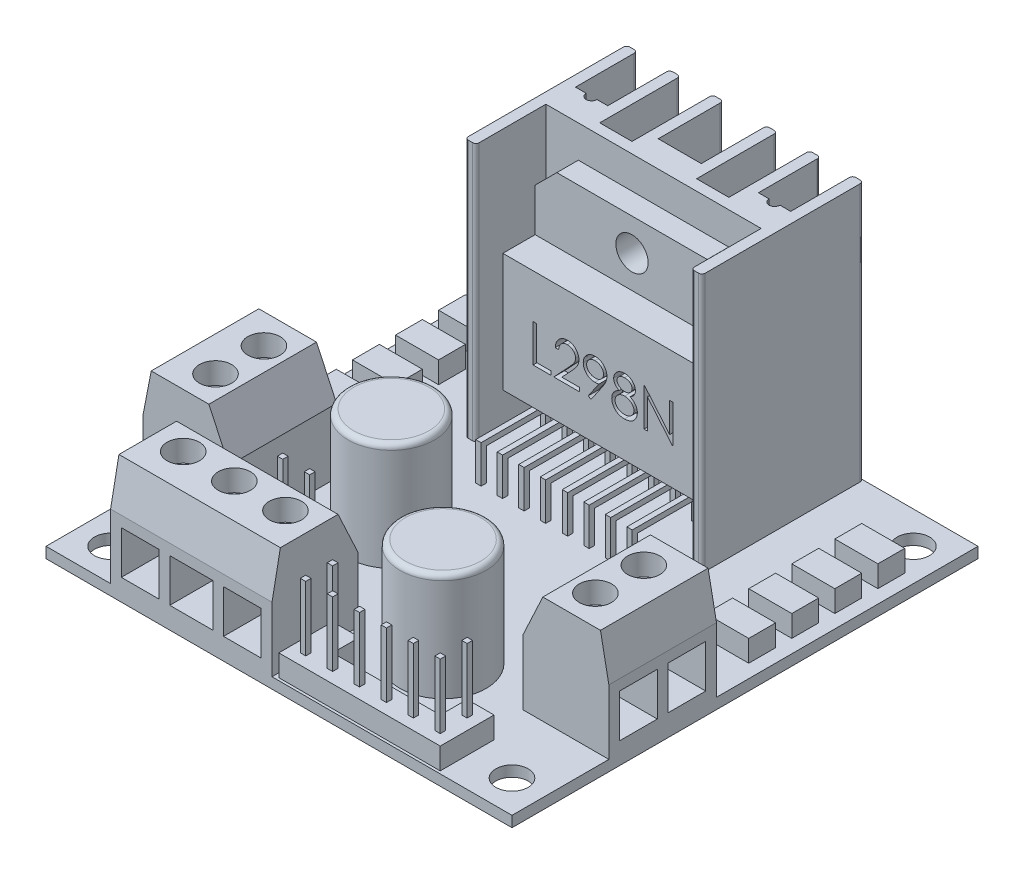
from build123d import *

# Parameters (mm, degrees)
CROQUIS1_W               = 43.3
CROQUIS1_H               = 43.3
CROQUIS1_R               = 1.5
SALIENTE_EXTRUIR1_DEPTH  = 1
CROQUIS2_W               = 1
CROQUIS2_H               = 1
CROQUIS2_H_2             = 6.5
CROQUIS2_W_2             = 3
CROQUIS2_W_3             = 2
CROQUIS2_H_3             = 1.435307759
SALIENTE_EXTRUIR2_DEPTH  = 24
CROQUIS3_W               = 8
CROQUIS3_H               = 10
SALIENTE_EXTRUIR3_DEPTH  = 10
CHAFL_N1_SIZE            = 4
CHAFL_N1_SIZE2           = 1.865230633
CHAFL_N2_SIZE            = 4
CHAFL_N2_SIZE2           = 1.865230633
CHAFL_N3_SIZE            = 4
CHAFL_N3_SIZE2           = 0.777521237
CHAFL_N4_SIZE            = 4
CHAFL_N4_SIZE2           = 0.777521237
CROQUIS4_W               = 15
CROQUIS4_H               = 8
SALIENTE_EXTRUIR4_DEPTH  = 10
CHAFL_N5_SIZE            = 4
CHAFL_N5_SIZE2           = 0.777521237
CHAFL_N6_SIZE            = 4
CHAFL_N6_SIZE2           = 1.865230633
CROQUIS5_W               = 4
CROQUIS5_H               = 2.5
SALIENTE_EXTRUIR5_DEPTH  = 2
CROQUIS6_R               = 4
SALIENTE_EXTRUIR6_DEPTH  = 10
REDONDEO1_R              = 0.5
SALIENTE_EXTRUIR7_DEPTH  = 2
CROQUIS8_W               = 2.5
CROQUIS8_H               = 2.5
SALIENTE_EXTRUIR8_DEPTH  = 2
CROQUIS9_W               = 0.25
CROQUIS9_H               = 0.25
CROQUIS9_H_2             = 0.5
CROQUIS9_W_2             = 0.5
SALIENTE_EXTRUIR9_DEPTH  = 6
CROQUIS10_W              = 0.5
CROQUIS10_H              = 0.5
SALIENTE_EXTRUIR10_DEPTH = 6
CROQUIS11_W              = 9
CROQUIS11_H              = 10
SALIENTE_EXTRUIR11_DEPTH = 5
CORTAR_EXTRUIR1_DEPTH    = 3
CROQUIS13_W              = 0.5
CROQUIS13_H              = 0.5
SALIENTE_EXTRUIR12_DEPTH = 1
CROQUIS14_W              = 0.5
CROQUIS14_H              = 0.5
SALIENTE_EXTRUIR13_DEPTH = 7
CROQUIS15_W              = 0.5
CROQUIS15_H              = 0.5
SALIENTE_EXTRUIR14_DEPTH = 4
CROQUIS16_W              = 0.5
CROQUIS16_H              = 0.5
SALIENTE_EXTRUIR15_DEPTH = 4
CORTAR_EXTRUIR2_DEPTH    = 1
CROQUIS18_R              = 1.5
CORTAR_EXTRUIR3_DEPTH    = 60.797407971
CROQUIS19_W              = 3.5
CROQUIS19_H              = 4
CORTAR_EXTRUIR4_DEPTH    = 4
CROQUIS20_W              = 3.5
CROQUIS20_H              = 4
CROQUIS20_W_2            = 4
CORTAR_EXTRUIR5_DEPTH    = 4
CROQUIS21_W              = 3.5
CROQUIS21_H              = 4
CORTAR_EXTRUIR6_DEPTH    = 4
CROQUIS22_R              = 1.5
CORTAR_EXTRUIR7_DEPTH    = 2
REDONDEO2_R              = 0.3


with BuildPart() as part:
    # Croquis1 → Saliente-Extruir1 (new body)
    with BuildSketch(Plane(origin=(0, 0, 0), x_dir=(1, 0, 0), z_dir=(0, 1, 0))):
        with Locations((-21.65, -21.65)):
            Rectangle(CROQUIS1_W, CROQUIS1_H)
        with Locations(Location((-40.3, -3, 0), (0, 0, 270))):
            Circle(CROQUIS1_R, mode=Mode.SUBTRACT)
        with Locations(Location((-3, -3, 0), (0, 0, 270))):
            Circle(CROQUIS1_R, mode=Mode.SUBTRACT)
        with Locations(Location((-40.3, -40.3, 0), (0, 0, 270))):
            Circle(CROQUIS1_R, mode=Mode.SUBTRACT)
        with Locations(Location((-3, -40.3, 0), (0, 0, 270))):
            Circle(CROQUIS1_R, mode=Mode.SUBTRACT)
    extrude(amount=SALIENTE_EXTRUIR1_DEPTH)

    # Croquis2 → Saliente-Extruir2 (add)
    with BuildSketch(Plane(origin=(0, 1, 0), x_dir=(-1, 0, 0), z_dir=(0, 1, 0))):
        Polygon((31.65, 5.75316787), (31.65, 0), (32.65, 0), (32.65, 7.5), (31.65, 7.5), align=None)
        with Locations((32.15, 8)):
            Rectangle(CROQUIS2_W, CROQUIS2_H)
        with Locations((32.15, 11.75)):
            Rectangle(CROQUIS2_W, CROQUIS2_H_2)
        with Locations((30.15, 8)):
            Rectangle(CROQUIS2_W_2, CROQUIS2_H)
        with Locations((28.15, 8)):
            Rectangle(CROQUIS2_W, CROQUIS2_H)
        with BuildLine():
            Line((31.65, 7.5), (28.65, 7.5))
            Line((28.65, 7.5), (28.65, 5.75316787))
            Line((28.65, 5.75316787), (29.645779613, 5.75316787))
            ThreePointArc((29.645779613, 5.75316787), (30.15, 6.257388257), (30.654220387, 5.75316787))
            Line((30.654220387, 5.75316787), (31.65, 5.75316787))
            Line((31.65, 5.75316787), (31.65, 7.5))
        make_face()
        with Locations((22.65, 6.782346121)):
            Rectangle(CROQUIS2_W_3, CROQUIS2_H_3)
        with Locations((20.65, 6.782346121)):
            Rectangle(CROQUIS2_W_3, CROQUIS2_H_3)
        Polygon((23.65, 6.064692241), (23.65, 0), (24.65, 0), (24.65, 7.5), (23.65, 7.5), align=None)
        Polygon((27.65, 7.5), (27.65, 0), (28.65, 0), (28.65, 5.75316787), (28.65, 7.5), align=None)
        with Locations((26.15, 8)):
            Rectangle(CROQUIS2_W_2, CROQUIS2_H)
        with Locations((24.15, 8)):
            Rectangle(CROQUIS2_W, CROQUIS2_H)
        with Locations((22.65, 8)):
            Rectangle(CROQUIS2_W_3, CROQUIS2_H)
        with Locations((20.65, 8)):
            Rectangle(CROQUIS2_W_3, CROQUIS2_H)
        with Locations((19.15, 8)):
            Rectangle(CROQUIS2_W, CROQUIS2_H)
        Polygon((18.65, 7.5), (18.65, 0), (19.65, 0), (19.65, 6.064692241), (19.65, 7.5), align=None)
        with Locations((17.15, 8)):
            Rectangle(CROQUIS2_W_2, CROQUIS2_H)
        with Locations((15.15, 8)):
            Rectangle(CROQUIS2_W, CROQUIS2_H)
        with Locations((13.15, 8)):
            Rectangle(CROQUIS2_W_2, CROQUIS2_H)
        with Locations((11.15, 11.75)):
            Rectangle(CROQUIS2_W, CROQUIS2_H_2)
        with Locations((11.15, 8)):
            Rectangle(CROQUIS2_W, CROQUIS2_H)
        Polygon((10.65, 7.5), (10.65, 0), (11.65, 0), (11.65, 5.75316787), (11.65, 7.5), align=None)
        with BuildLine():
            Line((14.65, 7.5), (11.65, 7.5))
            Line((11.65, 7.5), (11.65, 5.75316787))
            Line((11.65, 5.75316787), (12.645779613, 5.75316787))
            ThreePointArc((12.645779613, 5.75316787), (13.15, 6.257388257), (13.654220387, 5.75316787))
            Line((13.654220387, 5.75316787), (14.65, 5.75316787))
            Line((14.65, 5.75316787), (14.65, 7.5))
        make_face()
        Polygon((14.65, 5.75316787), (14.65, 0), (15.65, 0), (15.65, 7.5), (14.65, 7.5), align=None)
    extrude(amount=SALIENTE_EXTRUIR2_DEPTH)

    # Croquis3 → Saliente-Extruir3 (add)
    with BuildSketch(Plane(origin=(0, 1, 0), x_dir=(-1, 0, 0), z_dir=(0, 1, 0))):
        with Locations((39.3, 29.3)):
            Rectangle(CROQUIS3_W, CROQUIS3_H)
        with Locations((4, 29.3)):
            Rectangle(CROQUIS3_W, CROQUIS3_H)
    extrude(amount=SALIENTE_EXTRUIR3_DEPTH)

    # Chafl_n1
    chafl_n1_edges = [part.edges().sort_by_distance(p)[0] for p in [
        (-35.3, 11, 29.3),
    ]]
    chafl_n1_side = [part.faces().sort_by_distance(p)[0] for p in [
        (-35.3, 6, 29.3),
    ]]
    chamfer(chafl_n1_edges, length=CHAFL_N1_SIZE, length2=CHAFL_N1_SIZE2, reference=chafl_n1_side[0])

    # Chafl_n2
    chafl_n2_edges = [part.edges().sort_by_distance(p)[0] for p in [
        (-8, 11, 29.3),
    ]]
    chafl_n2_side = [part.faces().sort_by_distance(p)[0] for p in [
        (-8, 6, 29.3),
    ]]
    chamfer(chafl_n2_edges, length=CHAFL_N2_SIZE, length2=CHAFL_N2_SIZE2, reference=chafl_n2_side[0])

    # Chafl_n3
    chafl_n3_edges = [part.edges().sort_by_distance(p)[0] for p in [
        (0, 11, 29.3),
    ]]
    chafl_n3_side = [part.faces().sort_by_distance(p)[0] for p in [
        (0, 4.338101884, 26.988450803),
    ]]
    chamfer(chafl_n3_edges, length=CHAFL_N3_SIZE, length2=CHAFL_N3_SIZE2, reference=chafl_n3_side[0])

    # Chafl_n4
    chafl_n4_edges = [part.edges().sort_by_distance(p)[0] for p in [
        (-43.3, 11, 29.3),
    ]]
    chafl_n4_side = [part.faces().sort_by_distance(p)[0] for p in [
        (-43.3, 4.338101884, 26.988450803),
    ]]
    chamfer(chafl_n4_edges, length=CHAFL_N4_SIZE, length2=CHAFL_N4_SIZE2, reference=chafl_n4_side[0])

    # Croquis4 → Saliente-Extruir4 (add)
    with BuildSketch(Plane(origin=(0, 1, 0), x_dir=(-1, 0, 0), z_dir=(0, 1, 0))):
        with Locations((29.8, 39.3)):
            Rectangle(CROQUIS4_W, CROQUIS4_H)
    extrude(amount=SALIENTE_EXTRUIR4_DEPTH)

    # Chafl_n5
    chafl_n5_edges = [part.edges().sort_by_distance(p)[0] for p in [
        (-29.8, 11, 43.3),
    ]]
    chafl_n5_side = [part.faces().sort_by_distance(p)[0] for p in [
        (-27.97436627, 4.767977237, 43.3),
    ]]
    chamfer(chafl_n5_edges, length=CHAFL_N5_SIZE, length2=CHAFL_N5_SIZE2, reference=chafl_n5_side[0])

    # Chafl_n6
    chafl_n6_edges = [part.edges().sort_by_distance(p)[0] for p in [
        (-29.8, 11, 35.3),
    ]]
    chafl_n6_side = [part.faces().sort_by_distance(p)[0] for p in [
        (-29.8, 6, 35.3),
    ]]
    chamfer(chafl_n6_edges, length=CHAFL_N6_SIZE, length2=CHAFL_N6_SIZE2, reference=chafl_n6_side[0])

    # Croquis5 → Saliente-Extruir5 (add)
    with BuildSketch(Plane(origin=(0, 1, 0), x_dir=(-1, 0, 0), z_dir=(0, 1, 0))):
        with Locations((40.060783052, 10.814133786)):
            Rectangle(CROQUIS5_W, CROQUIS5_H)
        with Locations((40.060783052, 6.814133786)):
            Rectangle(CROQUIS5_W, CROQUIS5_H)
        with Locations((40.060783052, 14.814133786)):
            Rectangle(CROQUIS5_W, CROQUIS5_H)
        with Locations((40.060783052, 18.814133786)):
            Rectangle(CROQUIS5_W, CROQUIS5_H)
        with Locations((3.239216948, 6.814133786)):
            Rectangle(CROQUIS5_W, CROQUIS5_H)
        with Locations((3.239216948, 10.814133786)):
            Rectangle(CROQUIS5_W, CROQUIS5_H)
        with Locations((3.239216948, 14.814133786)):
            Rectangle(CROQUIS5_W, CROQUIS5_H)
        with Locations((3.239216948, 18.814133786)):
            Rectangle(CROQUIS5_W, CROQUIS5_H)
    extrude(amount=SALIENTE_EXTRUIR5_DEPTH)

    # Croquis6 → Saliente-Extruir6 (add)
    with BuildSketch(Plane(origin=(0, 1, 0), x_dir=(-1, 0, 0), z_dir=(0, 1, 0))):
        with Locations(Location((28.3, 26.210008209, 0), (0, 0, 90))):
            Circle(CROQUIS6_R)
        with Locations(Location((15.406645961, 34.3, 0), (0, 0, 90))):
            Circle(CROQUIS6_R)
    extrude(amount=SALIENTE_EXTRUIR6_DEPTH)

    # Redondeo1
    redondeo1_edges = [part.edges().sort_by_distance(p)[0] for p in [
        (-28.3, 11, 22.210008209),
        (-15.406645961, 11, 30.3),
    ]]
    fillet(redondeo1_edges, radius=REDONDEO1_R)

    # Croquis7 → Saliente-Extruir7 (add)
    with BuildSketch(Plane(origin=(0, 1, 0), x_dir=(-1, 0, 0), z_dir=(0, 1, 0))):
        Polygon((19.407725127, 40.559550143), (19.407725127, 38.059550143), (21.907725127, 38.059550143), (21.907725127, 40.559550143), (21.907725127, 43.059550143), (6.907725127, 43.059550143), (6.907725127, 38.059550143), (9.407725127, 38.059550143), (9.407725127, 40.559550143), align=None)
    extrude(amount=SALIENTE_EXTRUIR7_DEPTH)

    # Croquis8 → Saliente-Extruir8 (add)
    with BuildSketch(Plane(origin=(0, 1, 0), x_dir=(-1, 0, 0), z_dir=(0, 1, 0))):
        with Locations((29.05, 33.05)):
            Rectangle(CROQUIS8_W, CROQUIS8_H)
        with Locations((31.55, 33.05)):
            Rectangle(CROQUIS8_W, CROQUIS8_H)
    extrude(amount=SALIENTE_EXTRUIR8_DEPTH)

    # Croquis9 → Saliente-Extruir9 (add)
    with BuildSketch(Plane(origin=(0, 3, 0), x_dir=(-1, 0, 0), z_dir=(0, 1, 0))):
        with Locations((20.532725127, 41.934550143)):
            Rectangle(CROQUIS9_W, CROQUIS9_H)
        with Locations((20.532725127, 41.684550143)):
            Rectangle(CROQUIS9_W, CROQUIS9_H)
        with Locations((20.782725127, 41.934550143)):
            Rectangle(CROQUIS9_W, CROQUIS9_H)
        with Locations((20.782725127, 41.684550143)):
            Rectangle(CROQUIS9_W, CROQUIS9_H)
        with Locations((20.532725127, 39.309550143)):
            Rectangle(CROQUIS9_W, CROQUIS9_H_2)
        with Locations((20.782725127, 39.309550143)):
            Rectangle(CROQUIS9_W, CROQUIS9_H_2)
        with Locations((18.157725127, 41.684550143)):
            Rectangle(CROQUIS9_W_2, CROQUIS9_H)
        with Locations((18.157725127, 41.934550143)):
            Rectangle(CROQUIS9_W_2, CROQUIS9_H)
        with Locations((15.657725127, 41.684550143)):
            Rectangle(CROQUIS9_W_2, CROQUIS9_H)
        with Locations((15.657725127, 41.934550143)):
            Rectangle(CROQUIS9_W_2, CROQUIS9_H)
        with Locations((13.157725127, 41.934550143)):
            Rectangle(CROQUIS9_W_2, CROQUIS9_H)
        with Locations((13.157725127, 41.684550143)):
            Rectangle(CROQUIS9_W_2, CROQUIS9_H)
        with Locations((10.657725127, 41.934550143)):
            Rectangle(CROQUIS9_W_2, CROQUIS9_H)
        with Locations((10.657725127, 41.684550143)):
            Rectangle(CROQUIS9_W_2, CROQUIS9_H)
        with Locations((8.032725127, 41.934550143)):
            Rectangle(CROQUIS9_W, CROQUIS9_H)
        with Locations((8.032725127, 41.684550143)):
            Rectangle(CROQUIS9_W, CROQUIS9_H)
        with Locations((8.282725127, 41.684550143)):
            Rectangle(CROQUIS9_W, CROQUIS9_H)
        with Locations((8.282725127, 41.934550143)):
            Rectangle(CROQUIS9_W, CROQUIS9_H)
        with Locations((8.032725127, 39.309550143)):
            Rectangle(CROQUIS9_W, CROQUIS9_H_2)
        with Locations((8.282725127, 39.309550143)):
            Rectangle(CROQUIS9_W, CROQUIS9_H_2)
    extrude(amount=SALIENTE_EXTRUIR9_DEPTH)

    # Croquis10 → Saliente-Extruir10 (add)
    with BuildSketch(Plane(origin=(0, 3, 0), x_dir=(1, 0, 0), z_dir=(0, 1, 0))):
        with Locations((-29.05, -33.05)):
            Rectangle(CROQUIS10_W, CROQUIS10_H)
        with Locations((-31.55, -33.05)):
            Rectangle(CROQUIS10_W, CROQUIS10_H)
    extrude(amount=SALIENTE_EXTRUIR10_DEPTH)

    # Croquis11 → Saliente-Extruir11 (add)
    with BuildSketch(Plane.XY.offset(8.5)):
        Polygon((-21.65, 15), (-21.65, 22), (-28.637466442, 22), (-30.65, 19.987466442), (-30.65, 15), align=None)
        Polygon((-14.662533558, 22), (-21.65, 22), (-21.65, 15), (-12.65, 15), (-12.65, 19.987466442), align=None)
        with Locations((-26.15, 10)):
            Rectangle(CROQUIS11_W, CROQUIS11_H)
        with Locations((-17.15, 10)):
            Rectangle(CROQUIS11_W, CROQUIS11_H)
    extrude(amount=SALIENTE_EXTRUIR11_DEPTH)

    # Croquis12 → Cortar-Extruir1 (cut)
    with BuildSketch(Plane.XY.offset(13.5)):
        Polygon((-14.662533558, 22), (-28.637466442, 22), (-30.65, 19.987466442), (-30.65, 16), (-12.65, 16), (-12.65, 19.987466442), align=None)
    extrude(amount=-CORTAR_EXTRUIR1_DEPTH, mode=Mode.SUBTRACT)

    # Croquis13 → Saliente-Extruir12 (add)
    with BuildSketch(Plane.XZ.offset(-5)):
        with Locations((-28.173070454, 11)):
            Rectangle(CROQUIS13_W, CROQUIS13_H)
        with Locations((-29.173070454, 11)):
            Rectangle(CROQUIS13_W, CROQUIS13_H)
        with Locations((-27.173070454, 11)):
            Rectangle(CROQUIS13_W, CROQUIS13_H)
        with Locations((-26.173070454, 11)):
            Rectangle(CROQUIS13_W, CROQUIS13_H)
        with Locations((-25.173070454, 11)):
            Rectangle(CROQUIS13_W, CROQUIS13_H)
        with Locations((-24.173070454, 11)):
            Rectangle(CROQUIS13_W, CROQUIS13_H)
        with Locations((-23.173070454, 11)):
            Rectangle(CROQUIS13_W, CROQUIS13_H)
        with Locations((-22.173070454, 11)):
            Rectangle(CROQUIS13_W, CROQUIS13_H)
        with Locations((-21.126929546, 11)):
            Rectangle(CROQUIS13_W, CROQUIS13_H)
        with Locations((-20.126929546, 11)):
            Rectangle(CROQUIS13_W, CROQUIS13_H)
        with Locations((-19.126929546, 11)):
            Rectangle(CROQUIS13_W, CROQUIS13_H)
        with Locations((-18.126929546, 11)):
            Rectangle(CROQUIS13_W, CROQUIS13_H)
        with Locations((-17.126929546, 11)):
            Rectangle(CROQUIS13_W, CROQUIS13_H)
        with Locations((-16.126929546, 11)):
            Rectangle(CROQUIS13_W, CROQUIS13_H)
        with Locations((-15.126929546, 11)):
            Rectangle(CROQUIS13_W, CROQUIS13_H)
        with Locations((-14.126929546, 11)):
            Rectangle(CROQUIS13_W, CROQUIS13_H)
    extrude(amount=SALIENTE_EXTRUIR12_DEPTH)

    # Croquis14 → Saliente-Extruir13 (add)
    with BuildSketch(Plane.XY.offset(11.25)):
        with Locations((-14.126929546, 4.25)):
            Rectangle(CROQUIS14_W, CROQUIS14_H)
        with Locations((-16.126929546, 4.25)):
            Rectangle(CROQUIS14_W, CROQUIS14_H)
        with Locations((-18.126929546, 4.25)):
            Rectangle(CROQUIS14_W, CROQUIS14_H)
        with Locations((-20.126929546, 4.25)):
            Rectangle(CROQUIS14_W, CROQUIS14_H)
        with Locations((-22.173070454, 4.25)):
            Rectangle(CROQUIS14_W, CROQUIS14_H)
        with Locations((-24.173070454, 4.25)):
            Rectangle(CROQUIS14_W, CROQUIS14_H)
        with Locations((-26.173070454, 4.25)):
            Rectangle(CROQUIS14_W, CROQUIS14_H)
        with Locations((-28.173070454, 4.25)):
            Rectangle(CROQUIS14_W, CROQUIS14_H)
    extrude(amount=SALIENTE_EXTRUIR13_DEPTH)

    # Croquis15 → Saliente-Extruir14 (add)
    with BuildSketch(Plane.XZ):
        with Locations((-28.173070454, 18)):
            Rectangle(CROQUIS15_W, CROQUIS15_H)
        with Locations((-26.173070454, 18)):
            Rectangle(CROQUIS15_W, CROQUIS15_H)
        with Locations((-24.173070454, 18)):
            Rectangle(CROQUIS15_W, CROQUIS15_H)
        with Locations((-22.173070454, 18)):
            Rectangle(CROQUIS15_W, CROQUIS15_H)
        with Locations((-20.126929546, 18)):
            Rectangle(CROQUIS15_W, CROQUIS15_H)
        with Locations((-18.126929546, 18)):
            Rectangle(CROQUIS15_W, CROQUIS15_H)
        with Locations((-16.126929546, 18)):
            Rectangle(CROQUIS15_W, CROQUIS15_H)
        with Locations((-14.126929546, 18)):
            Rectangle(CROQUIS15_W, CROQUIS15_H)
    extrude(amount=-SALIENTE_EXTRUIR14_DEPTH)

    # Croquis16 → Saliente-Extruir15 (add)
    with BuildSketch(Plane.XZ):
        with Locations((-29.173070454, 11)):
            Rectangle(CROQUIS16_W, CROQUIS16_H)
        with Locations((-27.173070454, 11)):
            Rectangle(CROQUIS16_W, CROQUIS16_H)
        with Locations((-25.173070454, 11)):
            Rectangle(CROQUIS16_W, CROQUIS16_H)
        with Locations((-23.173070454, 11)):
            Rectangle(CROQUIS16_W, CROQUIS16_H)
        with Locations((-21.126929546, 11)):
            Rectangle(CROQUIS16_W, CROQUIS16_H)
        with Locations((-19.126929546, 11)):
            Rectangle(CROQUIS16_W, CROQUIS16_H)
        with Locations((-17.126929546, 11)):
            Rectangle(CROQUIS16_W, CROQUIS16_H)
        with Locations((-15.126929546, 11)):
            Rectangle(CROQUIS16_W, CROQUIS16_H)
    extrude(amount=-SALIENTE_EXTRUIR15_DEPTH)

    # Croquis17 → Cortar-Extruir2 (cut)
    # profile 1 of 5: a face of its own
    with BuildSketch(Plane.XY.offset(13.5)):
        Polygon((-27.846931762, 11.915865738), (-27.532829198, 11.915865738), (-27.532829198, 8.774840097), (-26.186675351, 8.774840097), (-26.186675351, 8.415865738), (-27.846931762, 8.415865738), align=None)
    # profile 2 of 5: a face of its own
    with BuildSketch(Plane.XY.offset(13.5)):
        with BuildLine():
            Line((-25.468726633, 10.838942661), (-25.782829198, 10.838942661))
            add(Edge.make_bspline(
                [(-25.782829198, 10.838942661), (-25.780782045, 10.880613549), (-25.77676149, 10.962454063), (-25.757933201, 11.08177797), (-25.730992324, 11.195832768), (-25.69290087, 11.303702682), (-25.645594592, 11.40634149), (-25.588864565, 11.503341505), (-25.521670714, 11.594332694), (-25.44546398, 11.678471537), (-25.362695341, 11.755659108), (-25.273389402, 11.822314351), (-25.179544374, 11.878632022), (-25.081444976, 11.925713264), (-24.977984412, 11.96105311), (-24.870101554, 11.98727475), (-24.757322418, 12.003051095), (-24.680482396, 12.004746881), (-24.641402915, 12.005609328)],
                knots=[0, 0, 0, 0, 1.10065271, 2.161652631, 3.183658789, 4.190468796, 5.17591951, 6.163126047, 7.15150782, 8.156236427, 9.156009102, 10.134482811, 11.092018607, 12.041330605, 13.001268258, 13.972401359, 14.968799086, 16, 16, 16, 16], degree=3))
            add(Edge.make_bspline(
                [(-24.641402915, 12.005609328), (-24.603024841, 12.004710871), (-24.527613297, 12.002945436), (-24.417551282, 11.987784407), (-24.312773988, 11.964038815), (-24.213486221, 11.930723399), (-24.120480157, 11.885938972), (-24.033057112, 11.832141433), (-23.950176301, 11.769921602), (-23.875569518, 11.696667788), (-23.807061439, 11.618465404), (-23.747959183, 11.5349775), (-23.69734602, 11.448748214), (-23.65515834, 11.359120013), (-23.624102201, 11.265248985), (-23.600523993, 11.168501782), (-23.587196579, 11.067876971), (-23.585151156, 10.999770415), (-23.584111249, 10.965144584)],
                knots=[0, 0, 0, 0, 1.111607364, 2.184268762, 3.212621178, 4.221274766, 5.211760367, 6.196651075, 7.1921475, 8.207485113, 9.220403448, 10.201281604, 11.166441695, 12.114753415, 13.065576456, 14.026450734, 14.996634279, 16, 16, 16, 16], degree=3))
            add(Edge.make_bspline(
                [(-23.584111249, 10.965144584), (-23.585804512, 10.916396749), (-23.589161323, 10.819756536), (-23.6178757, 10.677741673), (-23.662722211, 10.540148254), (-23.716719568, 10.429410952), (-23.771192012, 10.340177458), (-23.820279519, 10.266708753), (-23.87774433, 10.187603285), (-23.944422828, 10.103125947), (-24.0189357, 10.012615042), (-24.101957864, 9.916125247), (-24.194081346, 9.814653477), (-24.258739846, 9.745347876), (-24.292244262, 9.709435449)],
                knots=[0, 0, 0, 0, 1.184426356, 2.348067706, 3.509069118, 4.696110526, 5.333549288, 6.050745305, 6.844228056, 7.710549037, 8.667450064, 9.695053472, 10.805634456, 12, 12, 12, 12], degree=3))
            Line((-24.292244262, 9.709435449), (-25.167945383, 8.774840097))
            Line((-25.167945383, 8.774840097), (-23.539239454, 8.774840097))
            Line((-23.539239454, 8.774840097), (-23.539239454, 8.415865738))
            Line((-23.539239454, 8.415865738), (-25.917444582, 8.415865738))
            Line((-25.917444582, 8.415865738), (-24.560072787, 9.864383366))
            add(Edge.make_bspline(
                [(-24.560072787, 9.864383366), (-24.5270249, 9.898881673), (-24.463546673, 9.965145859), (-24.373764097, 10.061888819), (-24.293125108, 10.15163836), (-24.221107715, 10.234224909), (-24.15927421, 10.310856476), (-24.104401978, 10.37905118), (-24.060436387, 10.44180563), (-24.012720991, 10.514546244), (-23.96650701, 10.603358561), (-23.926794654, 10.711892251), (-23.902579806, 10.823619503), (-23.89967497, 10.89912154), (-23.898213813, 10.937099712)],
                knots=[0, 0, 0, 0, 1.329631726, 2.553950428, 3.673215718, 4.687767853, 5.603093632, 6.413772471, 7.123043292, 7.734684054, 8.834405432, 9.900288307, 10.943827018, 12, 12, 12, 12], degree=3))
            add(Edge.make_bspline(
                [(-23.898213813, 10.937099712), (-23.898849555, 10.960981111), (-23.900102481, 11.008046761), (-23.911160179, 11.07705252), (-23.927870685, 11.143617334), (-23.951815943, 11.207945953), (-23.983422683, 11.269391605), (-24.021896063, 11.328029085), (-24.066286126, 11.38471805), (-24.117637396, 11.437871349), (-24.174048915, 11.486552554), (-24.233643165, 11.529676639), (-24.296693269, 11.56571575), (-24.362933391, 11.595259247), (-24.432178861, 11.618434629), (-24.504563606, 11.634493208), (-24.579887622, 11.644575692), (-24.631321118, 11.645939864), (-24.657528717, 11.646634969)],
                knots=[0, 0, 0, 0, 0.991446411, 1.95395049, 2.89581595, 3.838931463, 4.798493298, 5.75982156, 6.748411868, 7.785213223, 8.824556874, 9.840280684, 10.836137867, 11.835679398, 12.848801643, 13.863922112, 14.911575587, 16, 16, 16, 16], degree=3))
            add(Edge.make_bspline(
                [(-24.657528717, 11.646634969), (-24.68489955, 11.645919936), (-24.738651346, 11.644515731), (-24.817570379, 11.634693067), (-24.892856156, 11.617747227), (-24.964698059, 11.594570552), (-25.033217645, 11.565112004), (-25.098081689, 11.528420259), (-25.159144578, 11.484636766), (-25.216521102, 11.434996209), (-25.269385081, 11.379728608), (-25.315831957, 11.318118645), (-25.356415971, 11.25129123), (-25.391825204, 11.179426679), (-25.420580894, 11.101872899), (-25.442554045, 11.018905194), (-25.459940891, 10.930883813), (-25.465749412, 10.870098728), (-25.468726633, 10.838942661)],
                knots=[0, 0, 0, 0, 1.031018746, 2.02475058, 2.990194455, 3.934040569, 4.864654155, 5.795059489, 6.735614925, 7.690564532, 8.649604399, 9.611025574, 10.590972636, 11.591080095, 12.624614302, 13.701020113, 14.821632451, 16, 16, 16, 16], degree=3))
        make_face()
    # profile 3 of 5: a face of its own
    with BuildSketch(Plane.XY.offset(13.5)):
        with BuildLine():
            Line((-22.462316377, 8.326122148), (-22.71331798, 8.500701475))
            Line((-22.71331798, 8.500701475), (-21.740160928, 9.923277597))
            add(Edge.make_bspline(
                [(-21.740160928, 9.923277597), (-21.802251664, 9.915684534), (-21.924511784, 9.900733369), (-22.047648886, 9.897986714), (-22.108249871, 9.896634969)],
                knots=[0, 0, 0, 0, 1.015715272, 2, 2, 2, 2], degree=3))
            add(Edge.make_bspline(
                [(-22.108249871, 9.896634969), (-22.144991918, 9.897576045), (-22.217113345, 9.899423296), (-22.323144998, 9.914065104), (-22.425030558, 9.936615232), (-22.522499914, 9.970263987), (-22.615919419, 10.012082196), (-22.705085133, 10.06393921), (-22.789877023, 10.124945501), (-22.869384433, 10.194778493), (-22.941696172, 10.271456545), (-23.00611947, 10.352612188), (-23.059660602, 10.439188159), (-23.104137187, 10.529418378), (-23.137867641, 10.624599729), (-23.162430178, 10.723649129), (-23.177552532, 10.827260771), (-23.179351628, 10.897785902), (-23.180265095, 10.933594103)],
                knots=[0, 0, 0, 0, 1.060718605, 2.082097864, 3.085795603, 4.069760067, 5.054557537, 6.03741023, 7.043284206, 8.066802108, 9.088538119, 10.083643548, 11.053783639, 12.022749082, 12.983451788, 13.964007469, 14.966251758, 16, 16, 16, 16], degree=3))
            add(Edge.make_bspline(
                [(-23.180265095, 10.933594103), (-23.17853066, 10.982562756), (-23.175126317, 11.078678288), (-23.147727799, 11.219112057), (-23.10266746, 11.3518986), (-23.039839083, 11.476688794), (-22.960704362, 11.591687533), (-22.865595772, 11.695296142), (-22.755091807, 11.786040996), (-22.631709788, 11.864045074), (-22.498356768, 11.926780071), (-22.358688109, 11.973019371), (-22.213773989, 12.000218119), (-22.115606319, 12.00380398), (-22.066182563, 12.005609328)],
                knots=[0, 0, 0, 0, 1.022988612, 2.007919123, 2.978103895, 3.94594894, 4.918897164, 5.887013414, 6.875921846, 7.89917871, 8.930658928, 9.948724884, 10.967259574, 12, 12, 12, 12], degree=3))
            add(Edge.make_bspline(
                [(-22.066182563, 12.005609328), (-22.017694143, 12.003779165), (-21.921885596, 12.000162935), (-21.78099659, 11.973678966), (-21.646055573, 11.929042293), (-21.517810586, 11.867357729), (-21.399071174, 11.790036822), (-21.292295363, 11.697902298), (-21.199919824, 11.590896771), (-21.122095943, 11.471608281), (-21.059625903, 11.343441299), (-21.01455362, 11.209657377), (-20.986807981, 11.071218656), (-20.983311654, 10.977424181), (-20.981547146, 10.930088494)],
                knots=[0, 0, 0, 0, 1.026385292, 2.028040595, 3.023318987, 4.028184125, 5.03290303, 6.015178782, 7.004435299, 8.016004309, 9.023023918, 10.015172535, 10.998308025, 12, 12, 12, 12], degree=3))
            add(Edge.make_bspline(
                [(-20.981547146, 10.930088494), (-20.982725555, 10.893344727), (-20.985115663, 10.818819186), (-21.00185197, 10.705588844), (-21.030272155, 10.590137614), (-21.062523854, 10.492416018), (-21.093656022, 10.411707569), (-21.122957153, 10.347955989), (-21.155469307, 10.280854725), (-21.193388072, 10.211107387), (-21.234150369, 10.137824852), (-21.280209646, 10.061742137), (-21.330515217, 9.982757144), (-21.366344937, 9.929510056), (-21.384692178, 9.902243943)],
                knots=[0, 0, 0, 0, 1.179839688, 2.393009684, 3.667231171, 4.993948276, 5.694988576, 6.444077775, 7.246288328, 8.089075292, 8.993003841, 9.939041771, 10.944649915, 12, 12, 12, 12], degree=3))
            Line((-21.384692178, 9.902243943), (-22.462316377, 8.326122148))
        make_face()
        with BuildLine():
            add(Edge.make_bspline(
                [(-22.050056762, 10.255609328), (-22.022222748, 10.256369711), (-21.968039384, 10.25784992), (-21.888662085, 10.266859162), (-21.813737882, 10.282833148), (-21.743066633, 10.30575286), (-21.675939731, 10.333409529), (-21.613423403, 10.368621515), (-21.555465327, 10.41063815), (-21.5016774, 10.457848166), (-21.453913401, 10.510298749), (-21.41137037, 10.565195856), (-21.375209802, 10.622780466), (-21.346646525, 10.683773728), (-21.32316195, 10.746690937), (-21.306943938, 10.812545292), (-21.297959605, 10.880993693), (-21.29642803, 10.927492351), (-21.29564971, 10.951122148)],
                knots=[0, 0, 0, 0, 1.163407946, 2.26475976, 3.333800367, 4.359385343, 5.366239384, 6.363380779, 7.350133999, 8.353570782, 9.349036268, 10.310270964, 11.253520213, 12.184142, 13.120487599, 14.056272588, 15.012232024, 16, 16, 16, 16], degree=3))
            add(Edge.make_bspline(
                [(-21.29564971, 10.951122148), (-21.29631938, 10.974761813), (-21.297639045, 11.021346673), (-21.308226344, 11.089896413), (-21.326851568, 11.155589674), (-21.351842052, 11.218786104), (-21.38476229, 11.278966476), (-21.424265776, 11.336886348), (-21.471198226, 11.392178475), (-21.525200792, 11.443542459), (-21.583435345, 11.490890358), (-21.645495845, 11.532676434), (-21.710870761, 11.567697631), (-21.779161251, 11.5965966), (-21.8505096, 11.619148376), (-21.924873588, 11.635365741), (-22.002628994, 11.644337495), (-22.05541028, 11.64585939), (-22.082308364, 11.646634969)],
                knots=[0, 0, 0, 0, 0.972161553, 1.915763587, 2.844109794, 3.775983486, 4.705125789, 5.659731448, 6.655561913, 7.682237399, 8.721216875, 9.739758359, 10.754845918, 11.767244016, 12.7857855, 13.828538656, 14.893392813, 16, 16, 16, 16], degree=3))
            add(Edge.make_bspline(
                [(-22.082308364, 11.646634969), (-22.108972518, 11.645858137), (-22.161287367, 11.644334), (-22.238351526, 11.635382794), (-22.312212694, 11.61903931), (-22.383354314, 11.596607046), (-22.451642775, 11.567695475), (-22.517014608, 11.532674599), (-22.579089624, 11.490899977), (-22.637268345, 11.443505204), (-22.691366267, 11.392417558), (-22.737491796, 11.336644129), (-22.777085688, 11.278996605), (-22.809960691, 11.218778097), (-22.834963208, 11.155591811), (-22.85358521, 11.089895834), (-22.864173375, 11.021346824), (-22.865492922, 10.974761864), (-22.866162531, 10.951122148)],
                knots=[0, 0, 0, 0, 1.099389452, 2.15699305, 3.192601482, 4.213358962, 5.227959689, 6.245255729, 7.266013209, 8.307253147, 9.336162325, 10.327954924, 11.284637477, 12.215801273, 13.149702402, 14.080068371, 15.025723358, 16, 16, 16, 16], degree=3))
            add(Edge.make_bspline(
                [(-22.866162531, 10.951122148), (-22.865556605, 10.927473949), (-22.864361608, 10.880835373), (-22.852833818, 10.81230898), (-22.833555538, 10.746620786), (-22.807736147, 10.683132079), (-22.773734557, 10.622460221), (-22.732010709, 10.564892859), (-22.683105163, 10.509777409), (-22.627671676, 10.457970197), (-22.567003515, 10.410418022), (-22.502206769, 10.36888764), (-22.434396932, 10.333815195), (-22.363335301, 10.305673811), (-22.289548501, 10.283062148), (-22.21237337, 10.266888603), (-22.132065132, 10.257936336), (-22.07765515, 10.256392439), (-22.050056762, 10.255609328)],
                knots=[0, 0, 0, 0, 0.952633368, 1.87876736, 2.791047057, 3.707742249, 4.635551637, 5.587206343, 6.568248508, 7.601284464, 8.641511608, 9.671105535, 10.699146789, 11.713763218, 12.747829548, 13.806491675, 14.887386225, 16, 16, 16, 16], degree=3))
        make_face(mode=Mode.SUBTRACT)
    # profile 4 of 5: a face of its own
    with BuildSketch(Plane.XY.offset(13.5)):
        with BuildLine():
            add(Edge.make_bspline(
                [(-18.831206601, 10.365685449), (-18.802558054, 10.350747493), (-18.74668382, 10.321613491), (-18.667106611, 10.274702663), (-18.59438161, 10.225261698), (-18.526491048, 10.175625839), (-18.464627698, 10.123894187), (-18.409483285, 10.069861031), (-18.359695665, 10.014875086), (-18.316268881, 9.958005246), (-18.278072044, 9.899402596), (-18.245059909, 9.838913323), (-18.216842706, 9.77666999), (-18.194479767, 9.71199316), (-18.176057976, 9.645832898), (-18.163382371, 9.577334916), (-18.156565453, 9.506950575), (-18.155276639, 9.459382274), (-18.154624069, 9.435296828)],
                knots=[0, 0, 0, 0, 1.272397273, 2.481599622, 3.635517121, 4.734568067, 5.792894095, 6.808321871, 7.773003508, 8.711915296, 9.623354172, 10.525449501, 11.423591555, 12.311487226, 13.218079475, 14.126165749, 15.051214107, 16, 16, 16, 16], degree=3))
            add(Edge.make_bspline(
                [(-18.154624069, 9.435296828), (-18.15539549, 9.401599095), (-18.156922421, 9.334898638), (-18.170222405, 9.236452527), (-18.190135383, 9.140840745), (-18.219214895, 9.048084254), (-18.256928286, 8.958694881), (-18.303405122, 8.872596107), (-18.356016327, 8.788376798), (-18.398268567, 8.736557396), (-18.419648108, 8.710336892)],
                knots=[0, 0, 0, 0, 1.025265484, 2.029385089, 3.018602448, 3.995076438, 4.983346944, 5.966715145, 6.97116228, 8, 8, 8, 8], degree=3))
            add(Edge.make_bspline(
                [(-18.419648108, 8.710336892), (-18.447484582, 8.679743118), (-18.502813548, 8.618933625), (-18.597596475, 8.539982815), (-18.701618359, 8.473633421), (-18.814476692, 8.419561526), (-18.935869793, 8.377475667), (-19.065771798, 8.347233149), (-19.204435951, 8.32991072), (-19.299741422, 8.327406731), (-19.348634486, 8.326122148)],
                knots=[0, 0, 0, 0, 0.954267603, 1.896743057, 2.838368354, 3.796610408, 4.779680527, 5.799409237, 6.871065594, 8, 8, 8, 8], degree=3))
            add(Edge.make_bspline(
                [(-19.348634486, 8.326122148), (-19.395647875, 8.327274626), (-19.487131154, 8.329517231), (-19.620289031, 8.344711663), (-19.744412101, 8.371339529), (-19.860222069, 8.407784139), (-19.967020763, 8.455194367), (-20.064503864, 8.514202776), (-20.154077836, 8.582434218), (-20.23302431, 8.661848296), (-20.303112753, 8.746906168), (-20.364680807, 8.834657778), (-20.415854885, 8.925111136), (-20.45918198, 9.016917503), (-20.492350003, 9.111363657), (-20.515322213, 9.20796367), (-20.529911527, 9.306548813), (-20.531852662, 9.373080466), (-20.532829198, 9.406550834)],
                knots=[0, 0, 0, 0, 1.256902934, 2.445805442, 3.576955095, 4.645999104, 5.686449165, 6.692658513, 7.68621702, 8.689161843, 9.678783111, 10.630372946, 11.551080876, 12.453998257, 13.34127905, 14.221779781, 15.105423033, 16, 16, 16, 16], degree=3))
            add(Edge.make_bspline(
                [(-20.532829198, 9.406550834), (-20.532251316, 9.431110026), (-20.53110922, 9.479647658), (-20.523204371, 9.551356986), (-20.51049591, 9.621153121), (-20.493236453, 9.689293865), (-20.469845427, 9.755283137), (-20.441603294, 9.819433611), (-20.408671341, 9.88181771), (-20.370590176, 9.942776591), (-20.326288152, 10.001456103), (-20.276124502, 10.058852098), (-20.219096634, 10.114073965), (-20.155838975, 10.16779639), (-20.087074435, 10.220972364), (-20.011016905, 10.270728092), (-19.929682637, 10.320586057), (-19.871877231, 10.350394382), (-19.84222423, 10.365685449)],
                knots=[0, 0, 0, 0, 0.941657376, 1.861047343, 2.762797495, 3.66048619, 4.553285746, 5.444104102, 6.34607688, 7.256116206, 8.197091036, 9.162375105, 10.176350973, 11.237807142, 12.343728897, 13.50695164, 14.721116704, 16, 16, 16, 16], degree=3))
            add(Edge.make_bspline(
                [(-19.84222423, 10.365685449), (-19.882815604, 10.387820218), (-19.961411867, 10.430679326), (-20.065481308, 10.509426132), (-20.154871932, 10.594713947), (-20.227126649, 10.688343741), (-20.283998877, 10.787390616), (-20.323017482, 10.891234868), (-20.349413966, 10.997950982), (-20.352028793, 11.070857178), (-20.353342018, 11.107472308)],
                knots=[0, 0, 0, 0, 1.166880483, 2.259407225, 3.286803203, 4.280235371, 5.237608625, 6.161067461, 7.076446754, 8, 8, 8, 8], degree=3))
            add(Edge.make_bspline(
                [(-20.353342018, 11.107472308), (-20.351706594, 11.144769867), (-20.348419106, 11.219744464), (-20.321835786, 11.331350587), (-20.278515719, 11.440967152), (-20.219594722, 11.548062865), (-20.146207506, 11.64901308), (-20.05816096, 11.739554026), (-19.957557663, 11.818865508), (-19.844899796, 11.885441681), (-19.723663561, 11.93962534), (-19.595747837, 11.977003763), (-19.463381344, 12.001439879), (-19.373283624, 12.004206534), (-19.327600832, 12.005609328)],
                knots=[0, 0, 0, 0, 0.888701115, 1.786444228, 2.72001202, 3.692817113, 4.693886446, 5.687152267, 6.695133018, 7.739871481, 8.800368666, 9.853104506, 10.91144658, 12, 12, 12, 12], degree=3))
            add(Edge.make_bspline(
                [(-19.327600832, 12.005609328), (-19.283097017, 12.004162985), (-19.195340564, 12.001310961), (-19.066345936, 11.977524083), (-18.942921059, 11.937794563), (-18.82549156, 11.88389734), (-18.716159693, 11.817510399), (-18.619557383, 11.737109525), (-18.534224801, 11.646967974), (-18.463640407, 11.546048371), (-18.405477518, 11.439364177), (-18.364976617, 11.327741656), (-18.339024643, 11.213592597), (-18.335751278, 11.136354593), (-18.334111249, 11.097656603)],
                knots=[0, 0, 0, 0, 1.072916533, 2.115669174, 3.151510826, 4.193348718, 5.225979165, 6.227137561, 7.216255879, 8.211077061, 9.189680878, 10.138522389, 11.067357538, 12, 12, 12, 12], degree=3))
            add(Edge.make_bspline(
                [(-18.334111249, 11.097656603), (-18.335545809, 11.059679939), (-18.338363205, 10.98509593), (-18.362063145, 10.87636941), (-18.401976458, 10.774547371), (-18.456470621, 10.678474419), (-18.527496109, 10.589892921), (-18.614104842, 10.507676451), (-18.71560632, 10.431149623), (-18.791867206, 10.387963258), (-18.831206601, 10.365685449)],
                knots=[0, 0, 0, 0, 0.975232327, 1.915300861, 2.843280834, 3.77672583, 4.742871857, 5.749627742, 6.839139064, 8, 8, 8, 8], degree=3))
        make_face()
        with BuildLine():
            add(Edge.make_bspline(
                [(-19.345128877, 11.646634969), (-19.369679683, 11.645983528), (-19.417711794, 11.644709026), (-19.488140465, 11.638050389), (-19.555112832, 11.625097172), (-19.619328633, 11.60785846), (-19.679907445, 11.584570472), (-19.737672, 11.557175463), (-19.79163919, 11.523869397), (-19.842460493, 11.486508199), (-19.888211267, 11.445415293), (-19.928815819, 11.402601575), (-19.962543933, 11.357226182), (-19.991185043, 11.310417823), (-20.01196656, 11.260787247), (-20.027530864, 11.20985607), (-20.038052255, 11.156980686), (-20.038840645, 11.120844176), (-20.039239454, 11.102564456)],
                knots=[0, 0, 0, 0, 1.203892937, 2.355340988, 3.463153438, 4.544400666, 5.610487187, 6.640501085, 7.674077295, 8.714426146, 9.728707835, 10.68524104, 11.601827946, 12.495867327, 13.368432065, 14.231010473, 15.105153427, 16, 16, 16, 16], degree=3))
            add(Edge.make_bspline(
                [(-20.039239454, 11.102564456), (-20.038552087, 11.084283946), (-20.037193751, 11.048159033), (-20.026688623, 10.994813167), (-20.011031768, 10.942391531), (-19.986381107, 10.89214062), (-19.956814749, 10.84231726), (-19.920323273, 10.794166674), (-19.876834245, 10.74752129), (-19.827806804, 10.702777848), (-19.774395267, 10.660879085), (-19.717811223, 10.624505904), (-19.658764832, 10.594071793), (-19.597862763, 10.568742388), (-19.534484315, 10.549052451), (-19.469017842, 10.535083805), (-19.40145234, 10.526401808), (-19.355671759, 10.525364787), (-19.332508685, 10.524840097)],
                knots=[0, 0, 0, 0, 0.873023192, 1.725219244, 2.590779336, 3.480155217, 4.391973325, 5.357036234, 6.360879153, 7.436073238, 8.526419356, 9.601555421, 10.645666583, 11.697338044, 12.750135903, 13.812665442, 14.89329948, 16, 16, 16, 16], degree=3))
            add(Edge.make_bspline(
                [(-19.332508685, 10.524840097), (-19.302758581, 10.525712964), (-19.243552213, 10.527450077), (-19.156272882, 10.543601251), (-19.071410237, 10.569007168), (-18.989871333, 10.603767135), (-18.913766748, 10.647394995), (-18.845926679, 10.699628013), (-18.786929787, 10.75926011), (-18.737389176, 10.825362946), (-18.69897933, 10.895714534), (-18.669077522, 10.966314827), (-18.651616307, 11.037917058), (-18.64933874, 11.085884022), (-18.648213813, 11.109575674)],
                knots=[0, 0, 0, 0, 1.076279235, 2.141928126, 3.20205304, 4.278698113, 5.344010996, 6.36967002, 7.368914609, 8.37248503, 9.349703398, 10.264243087, 11.142681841, 12, 12, 12, 12], degree=3))
            add(Edge.make_bspline(
                [(-18.648213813, 11.109575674), (-18.64874571, 11.12620371), (-18.649801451, 11.159207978), (-18.658501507, 11.207946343), (-18.67287734, 11.255575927), (-18.69234042, 11.302490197), (-18.717950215, 11.348030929), (-18.748314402, 11.392914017), (-18.785198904, 11.436129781), (-18.826595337, 11.47868533), (-18.873540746, 11.518069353), (-18.925944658, 11.552704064), (-18.983538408, 11.58211642), (-19.046323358, 11.606005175), (-19.114068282, 11.623947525), (-19.186461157, 11.637383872), (-19.264105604, 11.644956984), (-19.317535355, 11.646063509), (-19.345128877, 11.646634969)],
                knots=[0, 0, 0, 0, 0.814439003, 1.616544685, 2.417341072, 3.248991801, 4.09997495, 4.973547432, 5.9003056, 6.880240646, 7.880314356, 8.896779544, 9.951930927, 11.043077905, 12.18215768, 13.381699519, 14.647792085, 16, 16, 16, 16], degree=3))
        make_face(mode=Mode.SUBTRACT)
        with BuildLine():
            add(Edge.make_bspline(
                [(-19.324796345, 10.165865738), (-19.355922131, 10.165312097), (-19.416983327, 10.164225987), (-19.506440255, 10.152136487), (-19.592293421, 10.135307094), (-19.674253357, 10.109776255), (-19.752285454, 10.076579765), (-19.826812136, 10.036645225), (-19.897263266, 9.989439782), (-19.962665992, 9.935563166), (-20.022389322, 9.877503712), (-20.074787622, 9.816041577), (-20.119285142, 9.752319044), (-20.155118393, 9.685526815), (-20.184530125, 9.617079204), (-20.203844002, 9.545271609), (-20.216225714, 9.471484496), (-20.217888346, 9.421324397), (-20.218726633, 9.396034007)],
                knots=[0, 0, 0, 0, 1.140299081, 2.23698856, 3.303958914, 4.344563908, 5.37730929, 6.408454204, 7.439741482, 8.480804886, 9.510774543, 10.48932336, 11.43758569, 12.353841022, 13.263987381, 14.161954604, 15.073269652, 16, 16, 16, 16], degree=3))
            add(Edge.make_bspline(
                [(-20.218726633, 9.396034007), (-20.217363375, 9.364603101), (-20.214658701, 9.302244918), (-20.193202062, 9.210081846), (-20.158766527, 9.120860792), (-20.110741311, 9.035308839), (-20.051273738, 8.955358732), (-19.97814727, 8.885669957), (-19.895906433, 8.823748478), (-19.801768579, 8.773667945), (-19.698940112, 8.73367309), (-19.587448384, 8.706117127), (-19.468893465, 8.687875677), (-19.387033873, 8.686037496), (-19.345128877, 8.685096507)],
                knots=[0, 0, 0, 0, 0.898778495, 1.783155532, 2.693654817, 3.627872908, 4.583023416, 5.533784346, 6.509005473, 7.520592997, 8.575161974, 9.658835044, 10.801527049, 12, 12, 12, 12], degree=3))
            add(Edge.make_bspline(
                [(-19.345128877, 8.685096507), (-19.312378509, 8.685725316), (-19.24857029, 8.686950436), (-19.155484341, 8.69776473), (-19.067639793, 8.714914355), (-18.985206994, 8.739857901), (-18.907263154, 8.770307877), (-18.8351298, 8.809479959), (-18.766951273, 8.854032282), (-18.706087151, 8.906890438), (-18.650653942, 8.963369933), (-18.602320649, 9.023159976), (-18.560363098, 9.084635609), (-18.527432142, 9.149186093), (-18.501105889, 9.215573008), (-18.482182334, 9.284408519), (-18.470506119, 9.355903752), (-18.469325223, 9.404402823), (-18.468726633, 9.428986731)],
                knots=[0, 0, 0, 0, 1.224942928, 2.386581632, 3.501229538, 4.569074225, 5.605009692, 6.626002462, 7.634866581, 8.645888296, 9.63523824, 10.59253846, 11.518950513, 12.414518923, 13.29783783, 14.186679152, 15.080837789, 16, 16, 16, 16], degree=3))
            add(Edge.make_bspline(
                [(-18.468726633, 9.428986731), (-18.469632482, 9.452864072), (-18.471418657, 9.499946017), (-18.482755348, 9.569712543), (-18.502671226, 9.637115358), (-18.529998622, 9.702965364), (-18.566379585, 9.765928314), (-18.609224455, 9.827644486), (-18.660918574, 9.88640093), (-18.71933117, 9.942654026), (-18.782990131, 9.994669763), (-18.850657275, 10.040684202), (-18.921811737, 10.079436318), (-18.996302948, 10.110952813), (-19.073965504, 10.135740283), (-19.154742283, 10.153056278), (-19.238727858, 10.163955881), (-19.295782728, 10.165221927), (-19.324796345, 10.165865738)],
                knots=[0, 0, 0, 0, 0.917430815, 1.809013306, 2.70690318, 3.612392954, 4.541220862, 5.495268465, 6.494511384, 7.542276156, 8.608045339, 9.649016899, 10.681629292, 11.715607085, 12.752076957, 13.808767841, 14.885711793, 16, 16, 16, 16], degree=3))
        make_face(mode=Mode.SUBTRACT)
    # profile 5 of 5: a face of its own
    with BuildSketch(Plane.XY.offset(13.5)):
        Polygon((-17.526418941, 8.415865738), (-17.526418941, 11.915865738), (-17.460513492, 11.915865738), (-15.148213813, 9.161158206), (-15.148213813, 11.915865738), (-14.834111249, 11.915865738), (-14.834111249, 8.415865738), (-14.905625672, 8.415865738), (-17.212316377, 11.164263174), (-17.212316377, 8.415865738), align=None)
    extrude(amount=-CORTAR_EXTRUIR2_DEPTH, mode=Mode.SUBTRACT)

    # Croquis18 → Cortar-Extruir3 (cut, through all)
    with BuildSketch(Plane.XY.offset(10.5)):
        with Locations((-21.65, 19)):
            Circle(CROQUIS18_R)
    extrude(amount=-CORTAR_EXTRUIR3_DEPTH, mode=Mode.SUBTRACT)

    # Croquis19 → Cortar-Extruir4 (cut)
    with BuildSketch(Plane(origin=(0, 0, 0), x_dir=(0, 0, -1), z_dir=(1, 0, 0))):
        with Locations((-31.55, 4)):
            Rectangle(CROQUIS19_W, CROQUIS19_H)
        with Locations((-27.05, 4)):
            Rectangle(CROQUIS19_W, CROQUIS19_H)
    extrude(amount=-CORTAR_EXTRUIR4_DEPTH, mode=Mode.SUBTRACT)

    # Croquis20 → Cortar-Extruir5 (cut)
    with BuildSketch(Plane.XY.offset(43.3)):
        with Locations((-34.55, 4)):
            Rectangle(CROQUIS20_W, CROQUIS20_H)
        with Locations((-29.8, 4)):
            Rectangle(CROQUIS20_W_2, CROQUIS20_H)
        with Locations((-25.05, 4)):
            Rectangle(CROQUIS20_W, CROQUIS20_H)
    extrude(amount=-CORTAR_EXTRUIR5_DEPTH, mode=Mode.SUBTRACT)

    # Croquis21 → Cortar-Extruir6 (cut)
    with BuildSketch(Plane.ZY.offset(43.3)):
        with Locations((27.05, 4)):
            Rectangle(CROQUIS21_W, CROQUIS21_H)
        with Locations((31.55, 4)):
            Rectangle(CROQUIS21_W, CROQUIS21_H)
    extrude(amount=-CORTAR_EXTRUIR6_DEPTH, mode=Mode.SUBTRACT)

    # Croquis22 → Cortar-Extruir7 (cut)
    with BuildSketch(Plane(origin=(0, 11, 0), x_dir=(-1, 0, 0), z_dir=(0, 1, 0))):
        with Locations(Location((39.3, 27.05, 0), (0, 0, 90))):
            Circle(CROQUIS22_R)
        with Locations(Location((39.3, 31.55, 0), (0, 0, 90))):
            Circle(CROQUIS22_R)
        with Locations(Location((34.55, 39.3, 0), (0, 0, 90))):
            Circle(CROQUIS22_R)
        with Locations(Location((29.8, 39.3, 0), (0, 0, 90))):
            Circle(CROQUIS22_R)
        with Locations(Location((25.05, 39.3, 0), (0, 0, 90))):
            Circle(CROQUIS22_R)
        with Locations(Location((4, 31.55, 0), (0, 0, 90))):
            Circle(CROQUIS22_R)
        with Locations(Location((4, 27.05, 0), (0, 0, 90))):
            Circle(CROQUIS22_R)
    extrude(amount=-CORTAR_EXTRUIR7_DEPTH, mode=Mode.SUBTRACT)

    # Redondeo2
    redondeo2_edges = [part.edges().sort_by_distance(p)[0] for p in [
        (-10.65, 13, 15),
        (-10.65, 13, 0),
        (-11.65, 13, 0),
        (-14.65, 13, 0),
        (-15.65, 13, 0),
        (-18.65, 13, 0),
        (-19.65, 13, 0),
        (-23.65, 13, 0),
        (-24.65, 13, 0),
        (-27.65, 13, 0),
        (-28.65, 13, 0),
        (-31.65, 13, 0),
        (-32.65, 13, 0),
        (-32.65, 13, 15),
        (-31.65, 13, 15),
        (-11.65, 13, 15),
    ]]
    fillet(redondeo2_edges, radius=REDONDEO2_R)


solid = part.part
